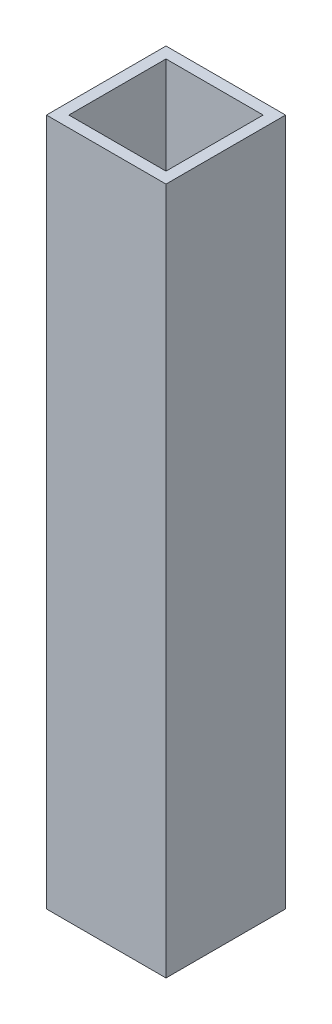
ISO-10303-21;
HEADER;
FILE_DESCRIPTION(('STEP AP214'),'2;1');
FILE_NAME('part.step','',(''),(''),'','','');
FILE_SCHEMA(('AUTOMOTIVE_DESIGN { 1 0 10303 214 1 1 1 1 }'));
ENDSEC;
DATA;
#1=APPLICATION_CONTEXT('core data for automotive mechanical design processes');
#2=APPLICATION_PROTOCOL_DEFINITION('international standard','automotive_design',2000,#1);
#3=PRODUCT_CONTEXT('',#1,'mechanical');
#4=PRODUCT('Part','Part','',(#3));
#5=PRODUCT_RELATED_PRODUCT_CATEGORY('part','',(#4));
#6=PRODUCT_DEFINITION_FORMATION('','',#4);
#7=PRODUCT_DEFINITION_CONTEXT('part definition',#1,'design');
#8=PRODUCT_DEFINITION('design','',#6,#7);
#9=PRODUCT_DEFINITION_SHAPE('','',#8);
#10=(LENGTH_UNIT() NAMED_UNIT(*) SI_UNIT(.MILLI.,.METRE.));
#11=(NAMED_UNIT(*) PLANE_ANGLE_UNIT() SI_UNIT($,.RADIAN.));
#12=(NAMED_UNIT(*) SI_UNIT($,.STERADIAN.) SOLID_ANGLE_UNIT());
#13=UNCERTAINTY_MEASURE_WITH_UNIT(LENGTH_MEASURE(1.E-05),#10,'distance_accuracy_value','');
#14=(GEOMETRIC_REPRESENTATION_CONTEXT(3) GLOBAL_UNCERTAINTY_ASSIGNED_CONTEXT((#13)) GLOBAL_UNIT_ASSIGNED_CONTEXT((#10,
#11,#12)) REPRESENTATION_CONTEXT('',''));
#15=CARTESIAN_POINT('',(0.,0.,0.));
#16=DIRECTION('',(0.,0.,1.));
#17=DIRECTION('',(1.,0.,0.));
#18=AXIS2_PLACEMENT_3D('',#15,#16,#17);
#19=CARTESIAN_POINT('',(25.4,-146.05,50.8));
#20=DIRECTION('',(1.,0.,0.));
#21=DIRECTION('',(0.,0.,-1.));
#22=AXIS2_PLACEMENT_3D('',#19,#20,#21);
#23=PLANE('',#22);
#24=DIRECTION('',(0.,0.,-1.));
#25=VECTOR('',#24,1.);
#26=CARTESIAN_POINT('',(25.4,146.05,50.8));
#27=LINE('',#26,#25);
#28=CARTESIAN_POINT('',(25.4,146.05,50.8));
#29=VERTEX_POINT('',#28);
#30=CARTESIAN_POINT('',(25.4,146.05,0.));
#31=VERTEX_POINT('',#30);
#32=EDGE_CURVE('E129',#29,#31,#27,.T.);
#33=ORIENTED_EDGE('',*,*,#32,.F.);
#34=DIRECTION('',(0.,1.,0.));
#35=VECTOR('',#34,1.);
#36=CARTESIAN_POINT('',(25.4,-146.05,50.8));
#37=LINE('',#36,#35);
#38=CARTESIAN_POINT('',(25.4,-146.05,50.8));
#39=VERTEX_POINT('',#38);
#40=EDGE_CURVE('E11',#39,#29,#37,.T.);
#41=ORIENTED_EDGE('',*,*,#40,.F.);
#42=DIRECTION('',(0.,0.,-1.));
#43=VECTOR('',#42,1.);
#44=CARTESIAN_POINT('',(25.4,-146.05,50.8));
#45=LINE('',#44,#43);
#46=CARTESIAN_POINT('',(25.4,-146.05,0.));
#47=VERTEX_POINT('',#46);
#48=EDGE_CURVE('E133',#39,#47,#45,.T.);
#49=ORIENTED_EDGE('',*,*,#48,.T.);
#50=DIRECTION('',(0.,1.,0.));
#51=VECTOR('',#50,1.);
#52=CARTESIAN_POINT('',(25.4,-146.05,0.));
#53=LINE('',#52,#51);
#54=EDGE_CURVE('E34',#47,#31,#53,.T.);
#55=ORIENTED_EDGE('',*,*,#54,.T.);
#56=EDGE_LOOP('',(#33,#41,#49,#55));
#57=FACE_BOUND('',#56,.T.);
#58=ADVANCED_FACE('F31',(#57),#23,.T.);
#59=CARTESIAN_POINT('',(-25.4,-146.05,50.8));
#60=DIRECTION('',(0.,0.,1.));
#61=DIRECTION('',(1.,0.,0.));
#62=AXIS2_PLACEMENT_3D('',#59,#60,#61);
#63=PLANE('',#62);
#64=DIRECTION('',(1.,0.,0.));
#65=VECTOR('',#64,1.);
#66=CARTESIAN_POINT('',(-25.4,146.05,50.8));
#67=LINE('',#66,#65);
#68=CARTESIAN_POINT('',(-25.4,146.05,50.8));
#69=VERTEX_POINT('',#68);
#70=EDGE_CURVE('E137',#69,#29,#67,.T.);
#71=ORIENTED_EDGE('',*,*,#70,.F.);
#72=DIRECTION('',(0.,1.,0.));
#73=VECTOR('',#72,1.);
#74=CARTESIAN_POINT('',(-25.4,-146.05,50.8));
#75=LINE('',#74,#73);
#76=CARTESIAN_POINT('',(-25.4,-146.05,50.8));
#77=VERTEX_POINT('',#76);
#78=EDGE_CURVE('E39',#77,#69,#75,.T.);
#79=ORIENTED_EDGE('',*,*,#78,.F.);
#80=DIRECTION('',(1.,0.,0.));
#81=VECTOR('',#80,1.);
#82=CARTESIAN_POINT('',(-25.4,-146.05,50.8));
#83=LINE('',#82,#81);
#84=EDGE_CURVE('E143',#77,#39,#83,.T.);
#85=ORIENTED_EDGE('',*,*,#84,.T.);
#86=ORIENTED_EDGE('',*,*,#40,.T.);
#87=EDGE_LOOP('',(#71,#79,#85,#86));
#88=FACE_BOUND('',#87,.T.);
#89=ADVANCED_FACE('F169',(#88),#63,.T.);
#90=CARTESIAN_POINT('',(-25.4,-146.05,0.));
#91=DIRECTION('',(-1.,0.,0.));
#92=DIRECTION('',(0.,0.,1.));
#93=AXIS2_PLACEMENT_3D('',#90,#91,#92);
#94=PLANE('',#93);
#95=DIRECTION('',(0.,0.,1.));
#96=VECTOR('',#95,1.);
#97=CARTESIAN_POINT('',(-25.4,146.05,0.));
#98=LINE('',#97,#96);
#99=CARTESIAN_POINT('',(-25.4,146.05,0.));
#100=VERTEX_POINT('',#99);
#101=EDGE_CURVE('E151',#100,#69,#98,.T.);
#102=ORIENTED_EDGE('',*,*,#101,.F.);
#103=DIRECTION('',(0.,1.,0.));
#104=VECTOR('',#103,1.);
#105=CARTESIAN_POINT('',(-25.4,-146.05,0.));
#106=LINE('',#105,#104);
#107=CARTESIAN_POINT('',(-25.4,-146.05,0.));
#108=VERTEX_POINT('',#107);
#109=EDGE_CURVE('E156',#108,#100,#106,.T.);
#110=ORIENTED_EDGE('',*,*,#109,.F.);
#111=DIRECTION('',(0.,0.,1.));
#112=VECTOR('',#111,1.);
#113=CARTESIAN_POINT('',(-25.4,-146.05,0.));
#114=LINE('',#113,#112);
#115=EDGE_CURVE('E140',#108,#77,#114,.T.);
#116=ORIENTED_EDGE('',*,*,#115,.T.);
#117=ORIENTED_EDGE('',*,*,#78,.T.);
#118=EDGE_LOOP('',(#102,#110,#116,#117));
#119=FACE_BOUND('',#118,.T.);
#120=ADVANCED_FACE('F173',(#119),#94,.T.);
#121=CARTESIAN_POINT('',(25.4,-146.05,0.));
#122=DIRECTION('',(0.,0.,-1.));
#123=DIRECTION('',(-1.,0.,0.));
#124=AXIS2_PLACEMENT_3D('',#121,#122,#123);
#125=PLANE('',#124);
#126=DIRECTION('',(-1.,0.,0.));
#127=VECTOR('',#126,1.);
#128=CARTESIAN_POINT('',(25.4,146.05,0.));
#129=LINE('',#128,#127);
#130=EDGE_CURVE('E148',#31,#100,#129,.T.);
#131=ORIENTED_EDGE('',*,*,#130,.F.);
#132=ORIENTED_EDGE('',*,*,#54,.F.);
#133=DIRECTION('',(-1.,0.,0.));
#134=VECTOR('',#133,1.);
#135=CARTESIAN_POINT('',(25.4,-146.05,0.));
#136=LINE('',#135,#134);
#137=EDGE_CURVE('E136',#47,#108,#136,.T.);
#138=ORIENTED_EDGE('',*,*,#137,.T.);
#139=ORIENTED_EDGE('',*,*,#109,.T.);
#140=EDGE_LOOP('',(#131,#132,#138,#139));
#141=FACE_BOUND('',#140,.T.);
#142=ADVANCED_FACE('F164',(#141),#125,.T.);
#143=CARTESIAN_POINT('',(25.4,-146.05,0.));
#144=DIRECTION('',(0.,1.,0.));
#145=DIRECTION('',(0.,0.,1.));
#146=AXIS2_PLACEMENT_3D('',#143,#144,#145);
#147=PLANE('',#146);
#148=DIRECTION('',(0.,0.,-1.));
#149=VECTOR('',#148,1.);
#150=CARTESIAN_POINT('',(20.6375,-146.05,4.7625));
#151=LINE('',#150,#149);
#152=CARTESIAN_POINT('',(20.6375,-146.05,46.0375));
#153=VERTEX_POINT('',#152);
#154=CARTESIAN_POINT('',(20.6375,-146.05,4.7625));
#155=VERTEX_POINT('',#154);
#156=EDGE_CURVE('E104',#153,#155,#151,.T.);
#157=ORIENTED_EDGE('',*,*,#156,.T.);
#158=DIRECTION('',(-1.,0.,0.));
#159=VECTOR('',#158,1.);
#160=CARTESIAN_POINT('',(-20.6375,-146.05,4.7625));
#161=LINE('',#160,#159);
#162=CARTESIAN_POINT('',(-20.6375,-146.05,4.7625));
#163=VERTEX_POINT('',#162);
#164=EDGE_CURVE('E98',#155,#163,#161,.T.);
#165=ORIENTED_EDGE('',*,*,#164,.T.);
#166=DIRECTION('',(0.,0.,1.));
#167=VECTOR('',#166,1.);
#168=CARTESIAN_POINT('',(-20.6375,-146.05,46.0375));
#169=LINE('',#168,#167);
#170=CARTESIAN_POINT('',(-20.6375,-146.05,46.0375));
#171=VERTEX_POINT('',#170);
#172=EDGE_CURVE('E107',#163,#171,#169,.T.);
#173=ORIENTED_EDGE('',*,*,#172,.T.);
#174=DIRECTION('',(1.,0.,0.));
#175=VECTOR('',#174,1.);
#176=CARTESIAN_POINT('',(20.6375,-146.05,46.0375));
#177=LINE('',#176,#175);
#178=EDGE_CURVE('E47',#171,#153,#177,.T.);
#179=ORIENTED_EDGE('',*,*,#178,.T.);
#180=EDGE_LOOP('',(#157,#165,#173,#179));
#181=FACE_BOUND('',#180,.T.);
#182=ORIENTED_EDGE('',*,*,#48,.F.);
#183=ORIENTED_EDGE('',*,*,#84,.F.);
#184=ORIENTED_EDGE('',*,*,#115,.F.);
#185=ORIENTED_EDGE('',*,*,#137,.F.);
#186=EDGE_LOOP('',(#182,#183,#184,#185));
#187=FACE_BOUND('',#186,.T.);
#188=ADVANCED_FACE('F111',(#181,#187),#147,.F.);
#189=CARTESIAN_POINT('',(25.4,146.05,0.));
#190=DIRECTION('',(0.,1.,0.));
#191=DIRECTION('',(0.,0.,1.));
#192=AXIS2_PLACEMENT_3D('',#189,#190,#191);
#193=PLANE('',#192);
#194=DIRECTION('',(-1.,0.,0.));
#195=VECTOR('',#194,1.);
#196=CARTESIAN_POINT('',(-20.6375,146.05,4.7625));
#197=LINE('',#196,#195);
#198=CARTESIAN_POINT('',(20.6375,146.05,4.7625));
#199=VERTEX_POINT('',#198);
#200=CARTESIAN_POINT('',(-20.6375,146.05,4.7625));
#201=VERTEX_POINT('',#200);
#202=EDGE_CURVE('E55',#199,#201,#197,.T.);
#203=ORIENTED_EDGE('',*,*,#202,.F.);
#204=DIRECTION('',(0.,0.,-1.));
#205=VECTOR('',#204,1.);
#206=CARTESIAN_POINT('',(20.6375,146.05,4.7625));
#207=LINE('',#206,#205);
#208=CARTESIAN_POINT('',(20.6375,146.05,46.0375));
#209=VERTEX_POINT('',#208);
#210=EDGE_CURVE('E114',#209,#199,#207,.T.);
#211=ORIENTED_EDGE('',*,*,#210,.F.);
#212=DIRECTION('',(1.,0.,0.));
#213=VECTOR('',#212,1.);
#214=CARTESIAN_POINT('',(20.6375,146.05,46.0375));
#215=LINE('',#214,#213);
#216=CARTESIAN_POINT('',(-20.6375,146.05,46.0375));
#217=VERTEX_POINT('',#216);
#218=EDGE_CURVE('E117',#217,#209,#215,.T.);
#219=ORIENTED_EDGE('',*,*,#218,.F.);
#220=DIRECTION('',(0.,0.,1.));
#221=VECTOR('',#220,1.);
#222=CARTESIAN_POINT('',(-20.6375,146.05,46.0375));
#223=LINE('',#222,#221);
#224=EDGE_CURVE('E123',#201,#217,#223,.T.);
#225=ORIENTED_EDGE('',*,*,#224,.F.);
#226=EDGE_LOOP('',(#203,#211,#219,#225));
#227=FACE_BOUND('',#226,.T.);
#228=ORIENTED_EDGE('',*,*,#32,.T.);
#229=ORIENTED_EDGE('',*,*,#130,.T.);
#230=ORIENTED_EDGE('',*,*,#101,.T.);
#231=ORIENTED_EDGE('',*,*,#70,.T.);
#232=EDGE_LOOP('',(#228,#229,#230,#231));
#233=FACE_BOUND('',#232,.T.);
#234=ADVANCED_FACE('F166',(#227,#233),#193,.T.);
#235=CARTESIAN_POINT('',(-20.6375,-146.05,4.7625));
#236=DIRECTION('',(0.,0.,-1.));
#237=DIRECTION('',(-1.,0.,0.));
#238=AXIS2_PLACEMENT_3D('',#235,#236,#237);
#239=PLANE('',#238);
#240=ORIENTED_EDGE('',*,*,#202,.T.);
#241=DIRECTION('',(0.,1.,0.));
#242=VECTOR('',#241,1.);
#243=CARTESIAN_POINT('',(-20.6375,-146.05,4.7625));
#244=LINE('',#243,#242);
#245=EDGE_CURVE('E94',#163,#201,#244,.T.);
#246=ORIENTED_EDGE('',*,*,#245,.F.);
#247=ORIENTED_EDGE('',*,*,#164,.F.);
#248=DIRECTION('',(0.,1.,0.));
#249=VECTOR('',#248,1.);
#250=CARTESIAN_POINT('',(20.6375,-146.05,4.7625));
#251=LINE('',#250,#249);
#252=EDGE_CURVE('E127',#155,#199,#251,.T.);
#253=ORIENTED_EDGE('',*,*,#252,.T.);
#254=EDGE_LOOP('',(#240,#246,#247,#253));
#255=FACE_BOUND('',#254,.T.);
#256=ADVANCED_FACE('F96',(#255),#239,.F.);
#257=CARTESIAN_POINT('',(20.6375,-146.05,4.7625));
#258=DIRECTION('',(1.,0.,0.));
#259=DIRECTION('',(0.,0.,-1.));
#260=AXIS2_PLACEMENT_3D('',#257,#258,#259);
#261=PLANE('',#260);
#262=ORIENTED_EDGE('',*,*,#210,.T.);
#263=ORIENTED_EDGE('',*,*,#252,.F.);
#264=ORIENTED_EDGE('',*,*,#156,.F.);
#265=DIRECTION('',(0.,1.,0.));
#266=VECTOR('',#265,1.);
#267=CARTESIAN_POINT('',(20.6375,-146.05,46.0375));
#268=LINE('',#267,#266);
#269=EDGE_CURVE('E130',#153,#209,#268,.T.);
#270=ORIENTED_EDGE('',*,*,#269,.T.);
#271=EDGE_LOOP('',(#262,#263,#264,#270));
#272=FACE_BOUND('',#271,.T.);
#273=ADVANCED_FACE('F224',(#272),#261,.F.);
#274=CARTESIAN_POINT('',(20.6375,-146.05,46.0375));
#275=DIRECTION('',(0.,0.,1.));
#276=DIRECTION('',(1.,0.,0.));
#277=AXIS2_PLACEMENT_3D('',#274,#275,#276);
#278=PLANE('',#277);
#279=ORIENTED_EDGE('',*,*,#218,.T.);
#280=ORIENTED_EDGE('',*,*,#269,.F.);
#281=ORIENTED_EDGE('',*,*,#178,.F.);
#282=DIRECTION('',(0.,1.,0.));
#283=VECTOR('',#282,1.);
#284=CARTESIAN_POINT('',(-20.6375,-146.05,46.0375));
#285=LINE('',#284,#283);
#286=EDGE_CURVE('E103',#171,#217,#285,.T.);
#287=ORIENTED_EDGE('',*,*,#286,.T.);
#288=EDGE_LOOP('',(#279,#280,#281,#287));
#289=FACE_BOUND('',#288,.T.);
#290=ADVANCED_FACE('F233',(#289),#278,.F.);
#291=CARTESIAN_POINT('',(-20.6375,-146.05,46.0375));
#292=DIRECTION('',(-1.,0.,0.));
#293=DIRECTION('',(0.,0.,1.));
#294=AXIS2_PLACEMENT_3D('',#291,#292,#293);
#295=PLANE('',#294);
#296=ORIENTED_EDGE('',*,*,#224,.T.);
#297=ORIENTED_EDGE('',*,*,#286,.F.);
#298=ORIENTED_EDGE('',*,*,#172,.F.);
#299=ORIENTED_EDGE('',*,*,#245,.T.);
#300=EDGE_LOOP('',(#296,#297,#298,#299));
#301=FACE_BOUND('',#300,.T.);
#302=ADVANCED_FACE('F108',(#301),#295,.F.);
#303=CLOSED_SHELL('',(#58,#89,#120,#142,#188,#234,#256,#273,#290,#302));
#304=MANIFOLD_SOLID_BREP('B2',#303);
#305=ADVANCED_BREP_SHAPE_REPRESENTATION('',(#18,#304),#14);
#306=SHAPE_DEFINITION_REPRESENTATION(#9,#305);
ENDSEC;
END-ISO-10303-21;
